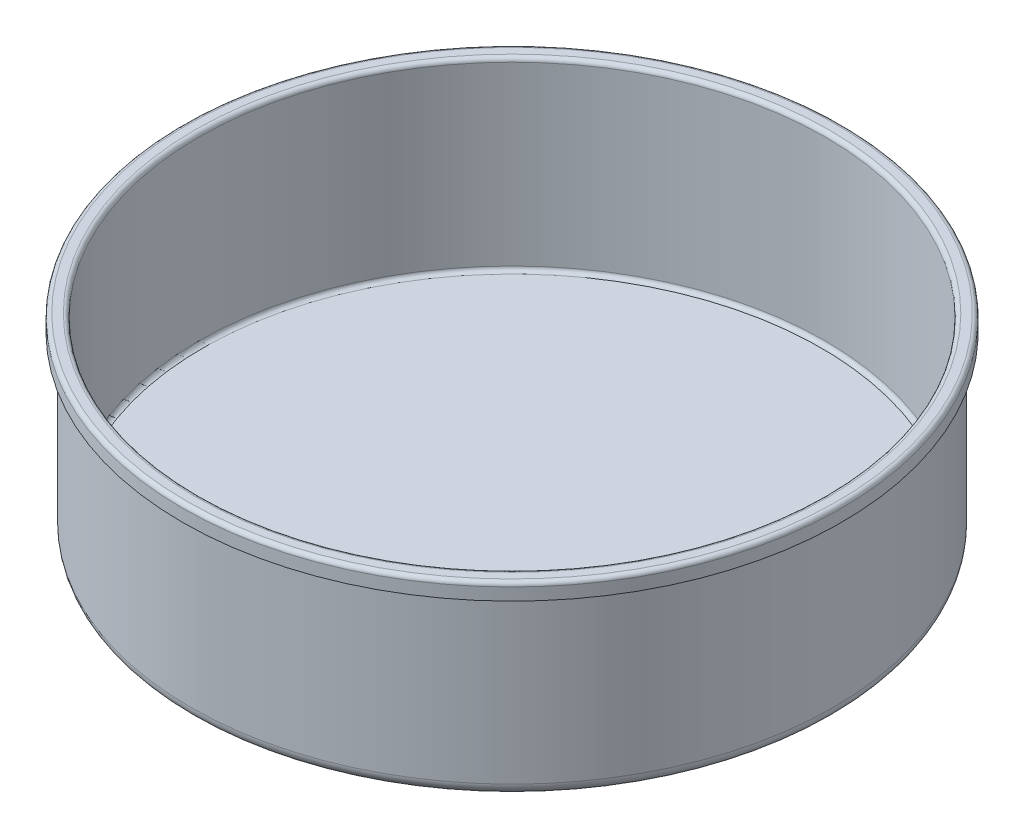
from build123d import *

# Parameters (mm, degrees)
SKETCH1_R           = 100
BOSS_EXTRUDE1_DEPTH = 60
FILLET1_R           = 3.81
SHELL1_T            = -2.54
BOSS_EXTRUDE2_START = -5.08
SKETCH2_R           = 102.54
SKETCH2_R_2         = 97.46
BOSS_EXTRUDE2_DEPTH = 5.08
FILLET2_R           = 1.27


with BuildPart() as part:
    # Sketch1 → Boss-Extrude1 (new body)
    with BuildSketch(Plane(origin=(0, 0, 0), x_dir=(1, 0, 0), z_dir=(0, 1, 0))):
        with Locations(Location((0, 0, 0), (0, 0, 270))):
            Circle(SKETCH1_R)
    extrude(amount=BOSS_EXTRUDE1_DEPTH)

    # Fillet1
    fillet1_edges = [part.edges().sort_by_distance(p)[0] for p in [
        (0, 0, -100),
    ]]
    fillet(fillet1_edges, radius=FILLET1_R)

    # Shell1
    shell1_openings = [part.faces().sort_by_distance(p)[0] for p in [
        (0, 60, 0),
    ]]
    offset(amount=SHELL1_T, openings=shell1_openings, kind=Kind.INTERSECTION)

    # Sketch2 → Boss-Extrude2 (add)
    with BuildSketch(Plane(origin=(0, 60, 0), x_dir=(1, 0, 0), z_dir=(0, 1, 0)).offset(BOSS_EXTRUDE2_START)):
        with Locations(Location((0, 0, 0), (0, 0, 270))):
            Circle(SKETCH2_R)
        with Locations(Location((0, 0, 0), (0, 0, 90))):
            Circle(SKETCH2_R_2, mode=Mode.SUBTRACT)
    extrude(amount=BOSS_EXTRUDE2_DEPTH)

    # Fillet2
    fillet2_edges = [part.edges().sort_by_distance(p)[0] for p in [
        (0, 60, -102.54),
        (0, 60, -97.46),
    ]]
    fillet(fillet2_edges, radius=FILLET2_R)


solid = part.part
